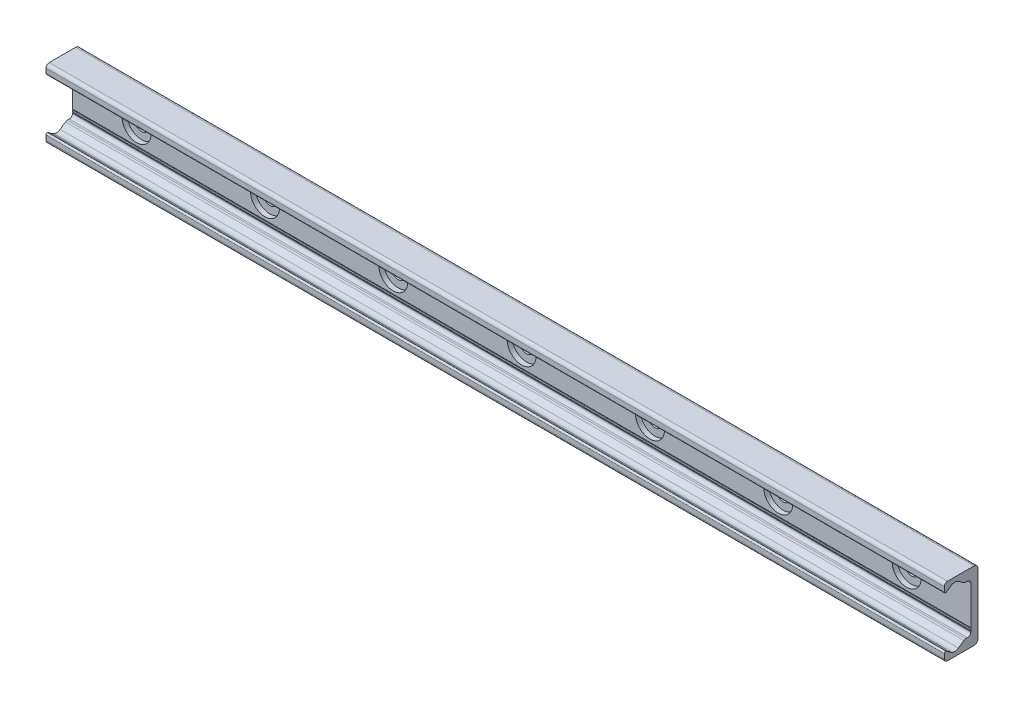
from build123d import *

# Parameters (mm, degrees)
BOSS_EXTRUDE1_DEPTH = 280
SKETCH2_R           = 9
SKETCH2_R_2         = 4.5
CUT_EXTRUDE1_DEPTH  = 3.1
SKETCH2_2_R         = 4.5
CUT_EXTRUDE2_DEPTH  = 282.308549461
LPATTERN1_COUNT     = 7
LPATTERN1_PITCH     = 80


with BuildPart() as part:
    # Sketch1 → Boss-Extrude1 (new, symmetric)
    with BuildSketch(Plane(origin=(0, 0, 0), x_dir=(0, 0, -1), z_dir=(1, 0, 0))):
        with BuildLine():
            Line((0, 0), (0, 19))
            ThreePointArc((0, 19), (-0.732233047, 20.767766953), (-2.5, 21.5))
            Line((-2.5, 21.5), (-19, 21.5))
            ThreePointArc((-19, 21.5), (-20.414213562, 20.914213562), (-21, 19.5))
            Line((-21, 19.5), (-21, 16.625057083))
            ThreePointArc((-21, 16.625057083), (-20.553251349, 15.888838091), (-19.693931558, 15.945160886))
            Line((-19.693931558, 15.945160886), (-16.794305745, 17.975500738))
            ThreePointArc((-16.794305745, 17.975500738), (-14.5, 18.69889256), (-12.205694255, 17.975500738))
            Line((-12.205694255, 17.975500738), (-8.829831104, 15.611695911))
            ThreePointArc((-8.829831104, 15.611695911), (-8.28408983, 15.342566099), (-7.682678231, 15.25))
            Line((-7.682678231, 15.25), (-6.5, 15.25))
            ThreePointArc((-6.5, 15.25), (-5.085786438, 14.664213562), (-4.5, 13.25))
            Line((-4.5, 13.25), (-4.5, -10.75))
            ThreePointArc((-4.5, -10.75), (-4.25, -11), (-4.5, -11.25))
            Line((-4.5, -11.25), (-4.5, -12.25))
            ThreePointArc((-4.5, -12.25), (-4.25, -12.5), (-4.5, -12.75))
            Line((-4.5, -12.75), (-4.5, -13.25))
            ThreePointArc((-4.5, -13.25), (-5.085786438, -14.664213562), (-6.5, -15.25))
            Line((-6.5, -15.25), (-7.682678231, -15.25))
            ThreePointArc((-7.682678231, -15.25), (-8.28408983, -15.342566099), (-8.829831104, -15.611695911))
            Line((-8.829831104, -15.611695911), (-12.205694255, -17.975500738))
            ThreePointArc((-12.205694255, -17.975500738), (-14.5, -18.69889256), (-16.794305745, -17.975500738))
            Line((-16.794305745, -17.975500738), (-19.693931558, -15.945160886))
            ThreePointArc((-19.693931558, -15.945160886), (-20.553251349, -15.888838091), (-21, -16.625057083))
            Line((-21, -16.625057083), (-21, -19.5))
            ThreePointArc((-21, -19.5), (-20.414213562, -20.914213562), (-19, -21.5))
            Line((-19, -21.5), (-2.5, -21.5))
            ThreePointArc((-2.5, -21.5), (-0.732233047, -20.767766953), (0, -19))
            Line((0, -19), (0, 0))
        make_face()
    extrude(amount=BOSS_EXTRUDE1_DEPTH, both=True)

    # Sketch2 → Cut-Extrude1 (cut)
    with BuildSketch(Plane.XY.offset(4.5)):
        with Locations((240, 0)):
            Circle(SKETCH2_R)
        with Locations((240, 0)):
            Circle(SKETCH2_R_2, mode=Mode.SUBTRACT)
    cut_extrude1 = extrude(amount=-CUT_EXTRUDE1_DEPTH, mode=Mode.SUBTRACT)

    # Sketch2_2 → Cut-Extrude2 (cut, through all)
    with BuildSketch(Plane.XY.offset(4.5)):
        with Locations((240, 0)):
            Circle(SKETCH2_2_R)
    cut_extrude2 = extrude(amount=-CUT_EXTRUDE2_DEPTH, mode=Mode.SUBTRACT)

    # LPattern1: Cut-Extrude1, Cut-Extrude2 ×7
    with Locations(*[(-i * LPATTERN1_PITCH, 0, 0) for i in range(1, LPATTERN1_COUNT)]):
        add(cut_extrude1, mode=Mode.SUBTRACT)
        add(cut_extrude2, mode=Mode.SUBTRACT)


solid = part.part
